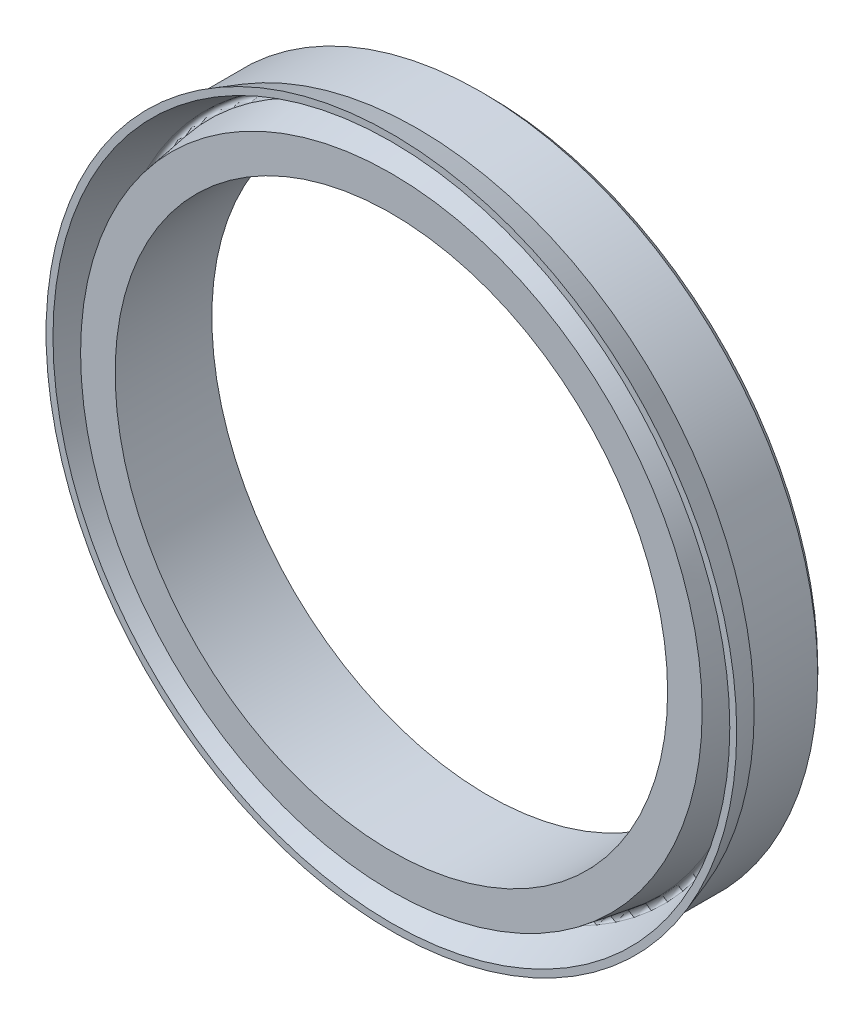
ISO-10303-21;
HEADER;
FILE_DESCRIPTION(('STEP AP214'),'2;1');
FILE_NAME('part.step','',(''),(''),'','','');
FILE_SCHEMA(('AUTOMOTIVE_DESIGN { 1 0 10303 214 1 1 1 1 }'));
ENDSEC;
DATA;
#1=APPLICATION_CONTEXT('core data for automotive mechanical design processes');
#2=APPLICATION_PROTOCOL_DEFINITION('international standard','automotive_design',2000,#1);
#3=PRODUCT_CONTEXT('',#1,'mechanical');
#4=PRODUCT('Part','Part','',(#3));
#5=PRODUCT_RELATED_PRODUCT_CATEGORY('part','',(#4));
#6=PRODUCT_DEFINITION_FORMATION('','',#4);
#7=PRODUCT_DEFINITION_CONTEXT('part definition',#1,'design');
#8=PRODUCT_DEFINITION('design','',#6,#7);
#9=PRODUCT_DEFINITION_SHAPE('','',#8);
#10=(LENGTH_UNIT() NAMED_UNIT(*) SI_UNIT(.MILLI.,.METRE.));
#11=(NAMED_UNIT(*) PLANE_ANGLE_UNIT() SI_UNIT($,.RADIAN.));
#12=(NAMED_UNIT(*) SI_UNIT($,.STERADIAN.) SOLID_ANGLE_UNIT());
#13=UNCERTAINTY_MEASURE_WITH_UNIT(LENGTH_MEASURE(1.E-05),#10,'distance_accuracy_value','');
#14=(GEOMETRIC_REPRESENTATION_CONTEXT(3) GLOBAL_UNCERTAINTY_ASSIGNED_CONTEXT((#13)) GLOBAL_UNIT_ASSIGNED_CONTEXT((#10,
#11,#12)) REPRESENTATION_CONTEXT('',''));
#15=CARTESIAN_POINT('',(0.,0.,0.));
#16=DIRECTION('',(0.,0.,1.));
#17=DIRECTION('',(1.,0.,0.));
#18=AXIS2_PLACEMENT_3D('',#15,#16,#17);
#19=CARTESIAN_POINT('',(0.,0.,20.));
#20=DIRECTION('',(0.,0.,1.));
#21=DIRECTION('',(1.,0.,0.));
#22=AXIS2_PLACEMENT_3D('',#19,#20,#21);
#23=CYLINDRICAL_SURFACE('',#22,19.9987942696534);
#24=CARTESIAN_POINT('',(0.,0.,-7.));
#25=DIRECTION('',(0.,0.,1.));
#26=DIRECTION('',(1.,0.,0.));
#27=AXIS2_PLACEMENT_3D('',#24,#25,#26);
#28=CIRCLE('',#27,19.9987942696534);
#29=CARTESIAN_POINT('',(19.9987942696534,0.,-7.));
#30=VERTEX_POINT('',#29);
#31=EDGE_CURVE('E371',#30,#30,#28,.T.);
#32=ORIENTED_EDGE('',*,*,#31,.F.);
#33=EDGE_LOOP('',(#32));
#34=FACE_BOUND('',#33,.T.);
#35=CARTESIAN_POINT('',(0.,0.,0.));
#36=DIRECTION('',(0.,0.,1.));
#37=DIRECTION('',(1.,0.,0.));
#38=AXIS2_PLACEMENT_3D('',#35,#36,#37);
#39=CIRCLE('',#38,19.9987942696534);
#40=CARTESIAN_POINT('',(19.9987942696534,0.,0.));
#41=VERTEX_POINT('',#40);
#42=EDGE_CURVE('E395',#41,#41,#39,.T.);
#43=ORIENTED_EDGE('',*,*,#42,.T.);
#44=EDGE_LOOP('',(#43));
#45=FACE_BOUND('',#44,.T.);
#46=ADVANCED_FACE('F361',(#34,#45),#23,.F.);
#47=CARTESIAN_POINT('',(0.,24.3675444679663,-7.));
#48=DIRECTION('',(0.,0.,1.));
#49=DIRECTION('',(1.,0.,0.));
#50=AXIS2_PLACEMENT_3D('',#47,#48,#49);
#51=PLANE('',#50);
#52=CARTESIAN_POINT('',(0.,0.,-7.));
#53=DIRECTION('',(0.,0.,1.));
#54=DIRECTION('',(1.,0.,0.));
#55=AXIS2_PLACEMENT_3D('',#52,#53,#54);
#56=CIRCLE('',#55,23.8675444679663);
#57=CARTESIAN_POINT('',(23.8675444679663,0.,-7.));
#58=VERTEX_POINT('',#57);
#59=EDGE_CURVE('E10',#58,#58,#56,.F.);
#60=ORIENTED_EDGE('',*,*,#59,.T.);
#61=EDGE_LOOP('',(#60));
#62=FACE_BOUND('',#61,.T.);
#63=ORIENTED_EDGE('',*,*,#31,.T.);
#64=EDGE_LOOP('',(#63));
#65=FACE_BOUND('',#64,.T.);
#66=ADVANCED_FACE('F439',(#62,#65),#51,.F.);
#67=CARTESIAN_POINT('',(0.,0.,20.));
#68=DIRECTION('',(0.,0.,1.));
#69=DIRECTION('',(1.,0.,0.));
#70=AXIS2_PLACEMENT_3D('',#67,#68,#69);
#71=CYLINDRICAL_SURFACE('',#70,24.3675444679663);
#72=CARTESIAN_POINT('',(0.,0.,-6.5));
#73=DIRECTION('',(0.,0.,1.));
#74=DIRECTION('',(1.,0.,0.));
#75=AXIS2_PLACEMENT_3D('',#72,#73,#74);
#76=CIRCLE('',#75,24.3675444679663);
#77=CARTESIAN_POINT('',(24.3675444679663,0.,-6.5));
#78=VERTEX_POINT('',#77);
#79=EDGE_CURVE('E367',#78,#78,#76,.T.);
#80=ORIENTED_EDGE('',*,*,#79,.T.);
#81=EDGE_LOOP('',(#80));
#82=FACE_BOUND('',#81,.T.);
#83=CARTESIAN_POINT('',(0.,0.,-1.89736659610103));
#84=DIRECTION('',(0.,0.,1.));
#85=DIRECTION('',(1.,0.,0.));
#86=AXIS2_PLACEMENT_3D('',#83,#84,#85);
#87=CIRCLE('',#86,24.3675444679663);
#88=CARTESIAN_POINT('',(24.3675444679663,0.,-1.89736659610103));
#89=VERTEX_POINT('',#88);
#90=EDGE_CURVE('E375',#89,#89,#87,.T.);
#91=ORIENTED_EDGE('',*,*,#90,.F.);
#92=EDGE_LOOP('',(#91));
#93=FACE_BOUND('',#92,.T.);
#94=ADVANCED_FACE('F434',(#82,#93),#71,.T.);
#95=CARTESIAN_POINT('',(0.,0.,-1.89736659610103));
#96=DIRECTION('',(0.,0.,1.));
#97=DIRECTION('',(1.,0.,0.));
#98=AXIS2_PLACEMENT_3D('',#95,#96,#97);
#99=CONICAL_SURFACE('',#98,24.3675444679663,0.321750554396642);
#100=CARTESIAN_POINT('',(0.,0.,0.));
#101=DIRECTION('',(0.,0.,1.));
#102=DIRECTION('',(1.,0.,0.));
#103=AXIS2_PLACEMENT_3D('',#100,#101,#102);
#104=CIRCLE('',#103,25.);
#105=CARTESIAN_POINT('',(25.,0.,0.));
#106=VERTEX_POINT('',#105);
#107=EDGE_CURVE('E380',#106,#106,#104,.T.);
#108=ORIENTED_EDGE('',*,*,#107,.F.);
#109=EDGE_LOOP('',(#108));
#110=FACE_BOUND('',#109,.T.);
#111=ORIENTED_EDGE('',*,*,#90,.T.);
#112=EDGE_LOOP('',(#111));
#113=FACE_BOUND('',#112,.T.);
#114=ADVANCED_FACE('F428',(#110,#113),#99,.T.);
#115=CARTESIAN_POINT('',(0.,24.5,0.));
#116=DIRECTION('',(0.,0.,-1.));
#117=DIRECTION('',(-1.,0.,0.));
#118=AXIS2_PLACEMENT_3D('',#115,#116,#117);
#119=PLANE('',#118);
#120=CARTESIAN_POINT('',(0.,0.,0.));
#121=DIRECTION('',(0.,0.,1.));
#122=DIRECTION('',(1.,0.,0.));
#123=AXIS2_PLACEMENT_3D('',#120,#121,#122);
#124=CIRCLE('',#123,24.5);
#125=CARTESIAN_POINT('',(24.5,0.,0.));
#126=VERTEX_POINT('',#125);
#127=EDGE_CURVE('E383',#126,#126,#124,.T.);
#128=ORIENTED_EDGE('',*,*,#127,.F.);
#129=EDGE_LOOP('',(#128));
#130=FACE_BOUND('',#129,.T.);
#131=ORIENTED_EDGE('',*,*,#107,.T.);
#132=EDGE_LOOP('',(#131));
#133=FACE_BOUND('',#132,.T.);
#134=ADVANCED_FACE('F422',(#130,#133),#119,.F.);
#135=CARTESIAN_POINT('',(0.,0.,0.));
#136=DIRECTION('',(0.,0.,1.));
#137=DIRECTION('',(1.,0.,0.));
#138=AXIS2_PLACEMENT_3D('',#135,#136,#137);
#139=CONICAL_SURFACE('',#138,24.5,0.321750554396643);
#140=CARTESIAN_POINT('',(0.,0.,-3.12034993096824));
#141=DIRECTION('',(0.,0.,1.));
#142=DIRECTION('',(1.,0.,0.));
#143=AXIS2_PLACEMENT_3D('',#140,#141,#142);
#144=CIRCLE('',#143,23.4598833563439);
#145=CARTESIAN_POINT('',(23.4598833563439,0.,-3.12034993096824));
#146=VERTEX_POINT('',#145);
#147=EDGE_CURVE('E386',#146,#146,#144,.T.);
#148=ORIENTED_EDGE('',*,*,#147,.F.);
#149=EDGE_LOOP('',(#148));
#150=FACE_BOUND('',#149,.T.);
#151=ORIENTED_EDGE('',*,*,#127,.T.);
#152=EDGE_LOOP('',(#151));
#153=FACE_BOUND('',#152,.T.);
#154=ADVANCED_FACE('F416',(#150,#153),#139,.F.);
#155=CARTESIAN_POINT('',(0.,0.,-3.04129298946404));
#156=DIRECTION('',(0.,0.,1.));
#157=DIRECTION('',(1.,0.,0.));
#158=AXIS2_PLACEMENT_3D('',#155,#156,#157);
#159=TOROIDAL_SURFACE('',#158,23.2227125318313,0.249999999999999);
#160=CARTESIAN_POINT('',(0.,0.,-3.07945463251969));
#161=DIRECTION('',(0.,0.,1.));
#162=DIRECTION('',(1.,0.,0.));
#163=AXIS2_PLACEMENT_3D('',#160,#161,#162);
#164=CIRCLE('',#163,22.9756423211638);
#165=CARTESIAN_POINT('',(22.9756423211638,0.,-3.07945463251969));
#166=VERTEX_POINT('',#165);
#167=EDGE_CURVE('E389',#166,#166,#164,.T.);
#168=ORIENTED_EDGE('',*,*,#167,.F.);
#169=EDGE_LOOP('',(#168));
#170=FACE_BOUND('',#169,.T.);
#171=ORIENTED_EDGE('',*,*,#147,.T.);
#172=EDGE_LOOP('',(#171));
#173=FACE_BOUND('',#172,.T.);
#174=ADVANCED_FACE('F410',(#170,#173),#159,.F.);
#175=CARTESIAN_POINT('',(0.,0.,-3.07945463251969));
#176=DIRECTION('',(0.,0.,-1.));
#177=DIRECTION('',(-1.,0.,0.));
#178=AXIS2_PLACEMENT_3D('',#175,#176,#177);
#179=CONICAL_SURFACE('',#178,22.9756423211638,0.153245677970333);
#180=CARTESIAN_POINT('',(0.,0.,0.));
#181=DIRECTION('',(0.,0.,1.));
#182=DIRECTION('',(1.,0.,0.));
#183=AXIS2_PLACEMENT_3D('',#180,#181,#182);
#184=CIRCLE('',#183,22.5);
#185=CARTESIAN_POINT('',(22.5,0.,0.));
#186=VERTEX_POINT('',#185);
#187=EDGE_CURVE('E392',#186,#186,#184,.T.);
#188=ORIENTED_EDGE('',*,*,#187,.F.);
#189=EDGE_LOOP('',(#188));
#190=FACE_BOUND('',#189,.T.);
#191=ORIENTED_EDGE('',*,*,#167,.T.);
#192=EDGE_LOOP('',(#191));
#193=FACE_BOUND('',#192,.T.);
#194=ADVANCED_FACE('F404',(#190,#193),#179,.T.);
#195=CARTESIAN_POINT('',(0.,19.9987942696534,0.));
#196=DIRECTION('',(0.,0.,-1.));
#197=DIRECTION('',(-1.,0.,0.));
#198=AXIS2_PLACEMENT_3D('',#195,#196,#197);
#199=PLANE('',#198);
#200=ORIENTED_EDGE('',*,*,#42,.F.);
#201=EDGE_LOOP('',(#200));
#202=FACE_BOUND('',#201,.T.);
#203=ORIENTED_EDGE('',*,*,#187,.T.);
#204=EDGE_LOOP('',(#203));
#205=FACE_BOUND('',#204,.T.);
#206=ADVANCED_FACE('F400',(#202,#205),#199,.F.);
#207=CARTESIAN_POINT('',(0.,0.,-6.5));
#208=DIRECTION('',(0.,0.,1.));
#209=DIRECTION('',(1.,0.,0.));
#210=AXIS2_PLACEMENT_3D('',#207,#208,#209);
#211=CONICAL_SURFACE('',#210,24.3675444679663,0.785398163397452);
#212=ORIENTED_EDGE('',*,*,#59,.F.);
#213=EDGE_LOOP('',(#212));
#214=FACE_BOUND('',#213,.T.);
#215=ORIENTED_EDGE('',*,*,#79,.F.);
#216=EDGE_LOOP('',(#215));
#217=FACE_BOUND('',#216,.T.);
#218=ADVANCED_FACE('F403',(#214,#217),#211,.T.);
#219=CLOSED_SHELL('',(#46,#66,#94,#114,#134,#154,#174,#194,#206,#218));
#220=MANIFOLD_SOLID_BREP('B2',#219);
#221=ADVANCED_BREP_SHAPE_REPRESENTATION('',(#18,#220),#14);
#222=SHAPE_DEFINITION_REPRESENTATION(#9,#221);
ENDSEC;
END-ISO-10303-21;
